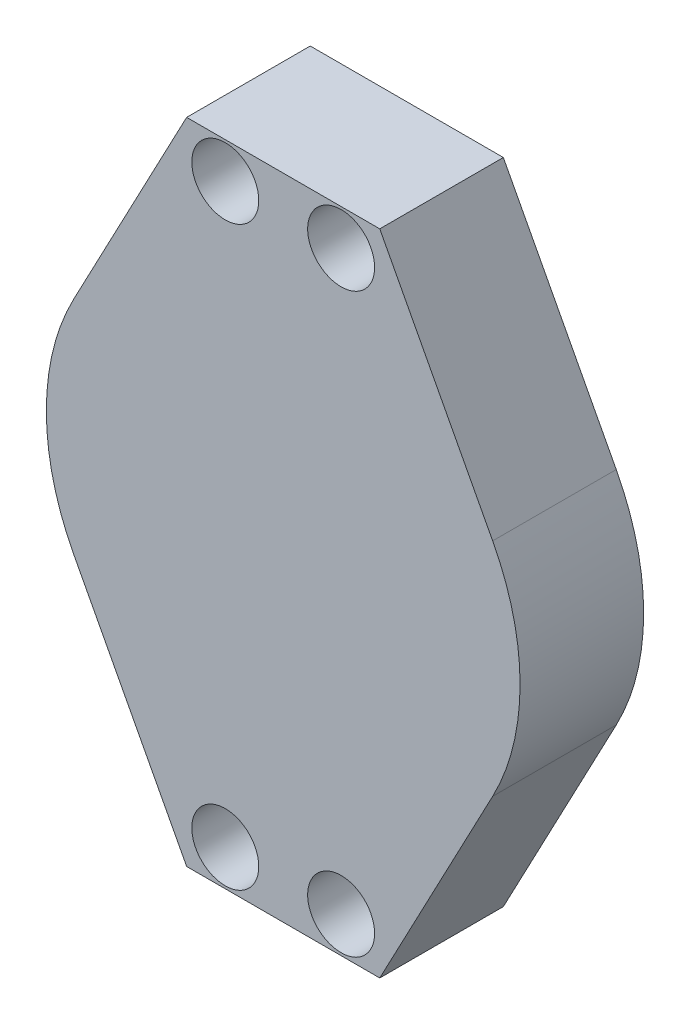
ISO-10303-21;
HEADER;
FILE_DESCRIPTION(('STEP AP214'),'2;1');
FILE_NAME('part.step','',(''),(''),'','','');
FILE_SCHEMA(('AUTOMOTIVE_DESIGN { 1 0 10303 214 1 1 1 1 }'));
ENDSEC;
DATA;
#1=APPLICATION_CONTEXT('core data for automotive mechanical design processes');
#2=APPLICATION_PROTOCOL_DEFINITION('international standard','automotive_design',2000,#1);
#3=PRODUCT_CONTEXT('',#1,'mechanical');
#4=PRODUCT('Part','Part','',(#3));
#5=PRODUCT_RELATED_PRODUCT_CATEGORY('part','',(#4));
#6=PRODUCT_DEFINITION_FORMATION('','',#4);
#7=PRODUCT_DEFINITION_CONTEXT('part definition',#1,'design');
#8=PRODUCT_DEFINITION('design','',#6,#7);
#9=PRODUCT_DEFINITION_SHAPE('','',#8);
#10=(LENGTH_UNIT() NAMED_UNIT(*) SI_UNIT(.MILLI.,.METRE.));
#11=(NAMED_UNIT(*) PLANE_ANGLE_UNIT() SI_UNIT($,.RADIAN.));
#12=(NAMED_UNIT(*) SI_UNIT($,.STERADIAN.) SOLID_ANGLE_UNIT());
#13=UNCERTAINTY_MEASURE_WITH_UNIT(LENGTH_MEASURE(1.E-05),#10,'distance_accuracy_value','');
#14=(GEOMETRIC_REPRESENTATION_CONTEXT(3) GLOBAL_UNCERTAINTY_ASSIGNED_CONTEXT((#13)) GLOBAL_UNIT_ASSIGNED_CONTEXT((#10,
#11,#12)) REPRESENTATION_CONTEXT('',''));
#15=CARTESIAN_POINT('',(0.,0.,0.));
#16=DIRECTION('',(0.,0.,1.));
#17=DIRECTION('',(1.,0.,0.));
#18=AXIS2_PLACEMENT_3D('',#15,#16,#17);
#19=CARTESIAN_POINT('',(-37.5,126.,48.));
#20=DIRECTION('',(0.884265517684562,-0.466984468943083,0.));
#21=DIRECTION('',(0.466984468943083,0.884265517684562,0.));
#22=AXIS2_PLACEMENT_3D('',#19,#20,#21);
#23=PLANE('',#22);
#24=DIRECTION('',(-0.466984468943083,-0.884265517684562,0.));
#25=VECTOR('',#24,1.);
#26=CARTESIAN_POINT('',(-37.5,126.,0.));
#27=LINE('',#26,#25);
#28=CARTESIAN_POINT('',(-37.5,126.,0.));
#29=VERTEX_POINT('',#28);
#30=CARTESIAN_POINT('',(-81.3524276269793,42.9625711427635,0.));
#31=VERTEX_POINT('',#30);
#32=EDGE_CURVE('E95',#29,#31,#27,.T.);
#33=ORIENTED_EDGE('',*,*,#32,.T.);
#34=DIRECTION('',(0.,0.,-1.));
#35=VECTOR('',#34,1.);
#36=CARTESIAN_POINT('',(-81.3524276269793,42.9625711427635,48.));
#37=LINE('',#36,#35);
#38=CARTESIAN_POINT('',(-81.3524276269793,42.9625711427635,48.));
#39=VERTEX_POINT('',#38);
#40=EDGE_CURVE('E11',#39,#31,#37,.T.);
#41=ORIENTED_EDGE('',*,*,#40,.F.);
#42=DIRECTION('',(-0.466984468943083,-0.884265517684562,0.));
#43=VECTOR('',#42,1.);
#44=CARTESIAN_POINT('',(-37.5,126.,48.));
#45=LINE('',#44,#43);
#46=CARTESIAN_POINT('',(-37.5,126.,48.));
#47=VERTEX_POINT('',#46);
#48=EDGE_CURVE('E127',#47,#39,#45,.T.);
#49=ORIENTED_EDGE('',*,*,#48,.F.);
#50=DIRECTION('',(0.,0.,-1.));
#51=VECTOR('',#50,1.);
#52=CARTESIAN_POINT('',(-37.5,126.,48.));
#53=LINE('',#52,#51);
#54=EDGE_CURVE('E108',#47,#29,#53,.T.);
#55=ORIENTED_EDGE('',*,*,#54,.T.);
#56=EDGE_LOOP('',(#33,#41,#49,#55));
#57=FACE_BOUND('',#56,.T.);
#58=ADVANCED_FACE('F27',(#57),#23,.F.);
#59=CARTESIAN_POINT('',(0.,0.,48.));
#60=DIRECTION('',(0.,0.,-1.));
#61=DIRECTION('',(-1.,0.,0.));
#62=AXIS2_PLACEMENT_3D('',#59,#60,#61);
#63=CYLINDRICAL_SURFACE('',#62,91.9999999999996);
#64=CARTESIAN_POINT('',(0.,0.,0.));
#65=DIRECTION('',(0.,0.,1.));
#66=DIRECTION('',(1.,0.,0.));
#67=AXIS2_PLACEMENT_3D('',#64,#65,#66);
#68=CIRCLE('',#67,91.9999999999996);
#69=CARTESIAN_POINT('',(-81.3524276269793,-42.9625711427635,0.));
#70=VERTEX_POINT('',#69);
#71=EDGE_CURVE('E91',#31,#70,#68,.T.);
#72=ORIENTED_EDGE('',*,*,#71,.T.);
#73=DIRECTION('',(0.,0.,-1.));
#74=VECTOR('',#73,1.);
#75=CARTESIAN_POINT('',(-81.3524276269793,-42.9625711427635,48.));
#76=LINE('',#75,#74);
#77=CARTESIAN_POINT('',(-81.3524276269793,-42.9625711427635,48.));
#78=VERTEX_POINT('',#77);
#79=EDGE_CURVE('E34',#78,#70,#76,.T.);
#80=ORIENTED_EDGE('',*,*,#79,.F.);
#81=CARTESIAN_POINT('',(0.,0.,48.));
#82=DIRECTION('',(0.,0.,1.));
#83=DIRECTION('',(1.,0.,0.));
#84=AXIS2_PLACEMENT_3D('',#81,#82,#83);
#85=CIRCLE('',#84,91.9999999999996);
#86=EDGE_CURVE('E104',#39,#78,#85,.T.);
#87=ORIENTED_EDGE('',*,*,#86,.F.);
#88=ORIENTED_EDGE('',*,*,#40,.T.);
#89=EDGE_LOOP('',(#72,#80,#87,#88));
#90=FACE_BOUND('',#89,.T.);
#91=ADVANCED_FACE('F103',(#90),#63,.T.);
#92=CARTESIAN_POINT('',(-37.5,-126.,48.));
#93=DIRECTION('',(0.884265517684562,0.466984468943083,0.));
#94=DIRECTION('',(-0.466984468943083,0.884265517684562,0.));
#95=AXIS2_PLACEMENT_3D('',#92,#93,#94);
#96=PLANE('',#95);
#97=DIRECTION('',(0.466984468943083,-0.884265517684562,0.));
#98=VECTOR('',#97,1.);
#99=CARTESIAN_POINT('',(-37.5,-126.,0.));
#100=LINE('',#99,#98);
#101=CARTESIAN_POINT('',(-37.5,-126.,0.));
#102=VERTEX_POINT('',#101);
#103=EDGE_CURVE('E97',#70,#102,#100,.T.);
#104=ORIENTED_EDGE('',*,*,#103,.T.);
#105=DIRECTION('',(0.,0.,-1.));
#106=VECTOR('',#105,1.);
#107=CARTESIAN_POINT('',(-37.5,-126.,48.));
#108=LINE('',#107,#106);
#109=CARTESIAN_POINT('',(-37.5,-126.,48.));
#110=VERTEX_POINT('',#109);
#111=EDGE_CURVE('E153',#110,#102,#108,.T.);
#112=ORIENTED_EDGE('',*,*,#111,.F.);
#113=DIRECTION('',(0.466984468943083,-0.884265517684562,0.));
#114=VECTOR('',#113,1.);
#115=CARTESIAN_POINT('',(-37.5,-126.,48.));
#116=LINE('',#115,#114);
#117=EDGE_CURVE('E130',#78,#110,#116,.T.);
#118=ORIENTED_EDGE('',*,*,#117,.F.);
#119=ORIENTED_EDGE('',*,*,#79,.T.);
#120=EDGE_LOOP('',(#104,#112,#118,#119));
#121=FACE_BOUND('',#120,.T.);
#122=ADVANCED_FACE('F157',(#121),#96,.F.);
#123=CARTESIAN_POINT('',(-37.5,-126.,48.));
#124=DIRECTION('',(0.,1.,0.));
#125=DIRECTION('',(0.,0.,1.));
#126=AXIS2_PLACEMENT_3D('',#123,#124,#125);
#127=PLANE('',#126);
#128=DIRECTION('',(1.,0.,0.));
#129=VECTOR('',#128,1.);
#130=CARTESIAN_POINT('',(-37.5,-126.,0.));
#131=LINE('',#130,#129);
#132=CARTESIAN_POINT('',(37.5,-126.,0.));
#133=VERTEX_POINT('',#132);
#134=EDGE_CURVE('E117',#102,#133,#131,.T.);
#135=ORIENTED_EDGE('',*,*,#134,.T.);
#136=DIRECTION('',(0.,0.,-1.));
#137=VECTOR('',#136,1.);
#138=CARTESIAN_POINT('',(37.5,-126.,48.));
#139=LINE('',#138,#137);
#140=CARTESIAN_POINT('',(37.5,-126.,48.));
#141=VERTEX_POINT('',#140);
#142=EDGE_CURVE('E150',#141,#133,#139,.T.);
#143=ORIENTED_EDGE('',*,*,#142,.F.);
#144=DIRECTION('',(1.,0.,0.));
#145=VECTOR('',#144,1.);
#146=CARTESIAN_POINT('',(-37.5,-126.,48.));
#147=LINE('',#146,#145);
#148=EDGE_CURVE('E132',#110,#141,#147,.T.);
#149=ORIENTED_EDGE('',*,*,#148,.F.);
#150=ORIENTED_EDGE('',*,*,#111,.T.);
#151=EDGE_LOOP('',(#135,#143,#149,#150));
#152=FACE_BOUND('',#151,.T.);
#153=ADVANCED_FACE('F165',(#152),#127,.F.);
#154=CARTESIAN_POINT('',(37.5,-126.,48.));
#155=DIRECTION('',(-0.884265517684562,0.466984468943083,0.));
#156=DIRECTION('',(-0.466984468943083,-0.884265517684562,0.));
#157=AXIS2_PLACEMENT_3D('',#154,#155,#156);
#158=PLANE('',#157);
#159=DIRECTION('',(0.466984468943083,0.884265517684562,0.));
#160=VECTOR('',#159,1.);
#161=CARTESIAN_POINT('',(37.5,-126.,0.));
#162=LINE('',#161,#160);
#163=CARTESIAN_POINT('',(81.3524276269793,-42.9625711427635,0.));
#164=VERTEX_POINT('',#163);
#165=EDGE_CURVE('E119',#133,#164,#162,.T.);
#166=ORIENTED_EDGE('',*,*,#165,.T.);
#167=DIRECTION('',(0.,0.,-1.));
#168=VECTOR('',#167,1.);
#169=CARTESIAN_POINT('',(81.3524276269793,-42.9625711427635,48.));
#170=LINE('',#169,#168);
#171=CARTESIAN_POINT('',(81.3524276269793,-42.9625711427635,48.));
#172=VERTEX_POINT('',#171);
#173=EDGE_CURVE('E147',#172,#164,#170,.T.);
#174=ORIENTED_EDGE('',*,*,#173,.F.);
#175=DIRECTION('',(0.466984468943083,0.884265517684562,0.));
#176=VECTOR('',#175,1.);
#177=CARTESIAN_POINT('',(37.5,-126.,48.));
#178=LINE('',#177,#176);
#179=EDGE_CURVE('E134',#141,#172,#178,.T.);
#180=ORIENTED_EDGE('',*,*,#179,.F.);
#181=ORIENTED_EDGE('',*,*,#142,.T.);
#182=EDGE_LOOP('',(#166,#174,#180,#181));
#183=FACE_BOUND('',#182,.T.);
#184=ADVANCED_FACE('F168',(#183),#158,.F.);
#185=CARTESIAN_POINT('',(0.,0.,48.));
#186=DIRECTION('',(0.,0.,-1.));
#187=DIRECTION('',(-1.,0.,0.));
#188=AXIS2_PLACEMENT_3D('',#185,#186,#187);
#189=CYLINDRICAL_SURFACE('',#188,91.9999999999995);
#190=CARTESIAN_POINT('',(0.,0.,0.));
#191=DIRECTION('',(0.,0.,1.));
#192=DIRECTION('',(1.,0.,0.));
#193=AXIS2_PLACEMENT_3D('',#190,#191,#192);
#194=CIRCLE('',#193,91.9999999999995);
#195=CARTESIAN_POINT('',(81.3524276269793,42.9625711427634,0.));
#196=VERTEX_POINT('',#195);
#197=EDGE_CURVE('E121',#164,#196,#194,.T.);
#198=ORIENTED_EDGE('',*,*,#197,.T.);
#199=DIRECTION('',(0.,0.,-1.));
#200=VECTOR('',#199,1.);
#201=CARTESIAN_POINT('',(81.3524276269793,42.9625711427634,48.));
#202=LINE('',#201,#200);
#203=CARTESIAN_POINT('',(81.3524276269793,42.9625711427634,48.));
#204=VERTEX_POINT('',#203);
#205=EDGE_CURVE('E144',#204,#196,#202,.T.);
#206=ORIENTED_EDGE('',*,*,#205,.F.);
#207=CARTESIAN_POINT('',(0.,0.,48.));
#208=DIRECTION('',(0.,0.,1.));
#209=DIRECTION('',(1.,0.,0.));
#210=AXIS2_PLACEMENT_3D('',#207,#208,#209);
#211=CIRCLE('',#210,91.9999999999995);
#212=EDGE_CURVE('E136',#172,#204,#211,.T.);
#213=ORIENTED_EDGE('',*,*,#212,.F.);
#214=ORIENTED_EDGE('',*,*,#173,.T.);
#215=EDGE_LOOP('',(#198,#206,#213,#214));
#216=FACE_BOUND('',#215,.T.);
#217=ADVANCED_FACE('F173',(#216),#189,.T.);
#218=CARTESIAN_POINT('',(37.5,126.,48.));
#219=DIRECTION('',(-0.884265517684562,-0.466984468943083,0.));
#220=DIRECTION('',(0.466984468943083,-0.884265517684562,0.));
#221=AXIS2_PLACEMENT_3D('',#218,#219,#220);
#222=PLANE('',#221);
#223=DIRECTION('',(-0.466984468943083,0.884265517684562,0.));
#224=VECTOR('',#223,1.);
#225=CARTESIAN_POINT('',(37.5,126.,0.));
#226=LINE('',#225,#224);
#227=CARTESIAN_POINT('',(37.5,126.,0.));
#228=VERTEX_POINT('',#227);
#229=EDGE_CURVE('E123',#196,#228,#226,.T.);
#230=ORIENTED_EDGE('',*,*,#229,.T.);
#231=DIRECTION('',(0.,0.,-1.));
#232=VECTOR('',#231,1.);
#233=CARTESIAN_POINT('',(37.5,126.,48.));
#234=LINE('',#233,#232);
#235=CARTESIAN_POINT('',(37.5,126.,48.));
#236=VERTEX_POINT('',#235);
#237=EDGE_CURVE('E141',#236,#228,#234,.T.);
#238=ORIENTED_EDGE('',*,*,#237,.F.);
#239=DIRECTION('',(-0.466984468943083,0.884265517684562,0.));
#240=VECTOR('',#239,1.);
#241=CARTESIAN_POINT('',(37.5,126.,48.));
#242=LINE('',#241,#240);
#243=EDGE_CURVE('E46',#204,#236,#242,.T.);
#244=ORIENTED_EDGE('',*,*,#243,.F.);
#245=ORIENTED_EDGE('',*,*,#205,.T.);
#246=EDGE_LOOP('',(#230,#238,#244,#245));
#247=FACE_BOUND('',#246,.T.);
#248=ADVANCED_FACE('F176',(#247),#222,.F.);
#249=CARTESIAN_POINT('',(-37.5,126.,48.));
#250=DIRECTION('',(0.,-1.,0.));
#251=DIRECTION('',(0.,0.,-1.));
#252=AXIS2_PLACEMENT_3D('',#249,#250,#251);
#253=PLANE('',#252);
#254=DIRECTION('',(-1.,0.,0.));
#255=VECTOR('',#254,1.);
#256=CARTESIAN_POINT('',(-37.5,126.,0.));
#257=LINE('',#256,#255);
#258=EDGE_CURVE('E125',#228,#29,#257,.T.);
#259=ORIENTED_EDGE('',*,*,#258,.T.);
#260=ORIENTED_EDGE('',*,*,#54,.F.);
#261=DIRECTION('',(-1.,0.,0.));
#262=VECTOR('',#261,1.);
#263=CARTESIAN_POINT('',(-37.5,126.,48.));
#264=LINE('',#263,#262);
#265=EDGE_CURVE('E41',#236,#47,#264,.T.);
#266=ORIENTED_EDGE('',*,*,#265,.F.);
#267=ORIENTED_EDGE('',*,*,#237,.T.);
#268=EDGE_LOOP('',(#259,#260,#266,#267));
#269=FACE_BOUND('',#268,.T.);
#270=ADVANCED_FACE('F178',(#269),#253,.F.);
#271=CARTESIAN_POINT('',(0.,0.,48.));
#272=DIRECTION('',(0.,0.,1.));
#273=DIRECTION('',(1.,0.,0.));
#274=AXIS2_PLACEMENT_3D('',#271,#272,#273);
#275=PLANE('',#274);
#276=CARTESIAN_POINT('',(-22.5,-112.,48.));
#277=DIRECTION('',(0.,0.,1.));
#278=DIRECTION('',(1.,0.,0.));
#279=AXIS2_PLACEMENT_3D('',#276,#277,#278);
#280=CIRCLE('',#279,13.);
#281=CARTESIAN_POINT('',(-9.50000000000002,-112.,48.));
#282=VERTEX_POINT('',#281);
#283=EDGE_CURVE('E347',#282,#282,#280,.T.);
#284=ORIENTED_EDGE('',*,*,#283,.F.);
#285=EDGE_LOOP('',(#284));
#286=FACE_BOUND('',#285,.T.);
#287=CARTESIAN_POINT('',(22.5,-112.,48.));
#288=DIRECTION('',(0.,0.,1.));
#289=DIRECTION('',(1.,0.,0.));
#290=AXIS2_PLACEMENT_3D('',#287,#288,#289);
#291=CIRCLE('',#290,13.);
#292=CARTESIAN_POINT('',(35.5,-112.,48.));
#293=VERTEX_POINT('',#292);
#294=EDGE_CURVE('E362',#293,#293,#291,.T.);
#295=ORIENTED_EDGE('',*,*,#294,.F.);
#296=EDGE_LOOP('',(#295));
#297=FACE_BOUND('',#296,.T.);
#298=CARTESIAN_POINT('',(22.5,112.,48.));
#299=DIRECTION('',(0.,0.,1.));
#300=DIRECTION('',(1.,0.,0.));
#301=AXIS2_PLACEMENT_3D('',#298,#299,#300);
#302=CIRCLE('',#301,13.);
#303=CARTESIAN_POINT('',(35.5,112.,48.));
#304=VERTEX_POINT('',#303);
#305=EDGE_CURVE('E374',#304,#304,#302,.T.);
#306=ORIENTED_EDGE('',*,*,#305,.F.);
#307=EDGE_LOOP('',(#306));
#308=FACE_BOUND('',#307,.T.);
#309=CARTESIAN_POINT('',(-22.5,112.,48.));
#310=DIRECTION('',(0.,0.,1.));
#311=DIRECTION('',(1.,0.,0.));
#312=AXIS2_PLACEMENT_3D('',#309,#310,#311);
#313=CIRCLE('',#312,13.);
#314=CARTESIAN_POINT('',(-9.50000000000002,112.,48.));
#315=VERTEX_POINT('',#314);
#316=EDGE_CURVE('E386',#315,#315,#313,.T.);
#317=ORIENTED_EDGE('',*,*,#316,.F.);
#318=EDGE_LOOP('',(#317));
#319=FACE_BOUND('',#318,.T.);
#320=ORIENTED_EDGE('',*,*,#48,.T.);
#321=ORIENTED_EDGE('',*,*,#86,.T.);
#322=ORIENTED_EDGE('',*,*,#117,.T.);
#323=ORIENTED_EDGE('',*,*,#148,.T.);
#324=ORIENTED_EDGE('',*,*,#179,.T.);
#325=ORIENTED_EDGE('',*,*,#212,.T.);
#326=ORIENTED_EDGE('',*,*,#243,.T.);
#327=ORIENTED_EDGE('',*,*,#265,.T.);
#328=EDGE_LOOP('',(#320,#321,#322,#323,#324,#325,#326,#327));
#329=FACE_BOUND('',#328,.T.);
#330=ADVANCED_FACE('F160',(#286,#297,#308,#319,#329),#275,.T.);
#331=CARTESIAN_POINT('',(0.,0.,0.));
#332=DIRECTION('',(0.,0.,1.));
#333=DIRECTION('',(1.,0.,0.));
#334=AXIS2_PLACEMENT_3D('',#331,#332,#333);
#335=PLANE('',#334);
#336=CARTESIAN_POINT('',(-22.5,-112.,0.));
#337=DIRECTION('',(0.,0.,1.));
#338=DIRECTION('',(1.,0.,0.));
#339=AXIS2_PLACEMENT_3D('',#336,#337,#338);
#340=CIRCLE('',#339,6.49999999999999);
#341=CARTESIAN_POINT('',(-16.,-112.,0.));
#342=VERTEX_POINT('',#341);
#343=EDGE_CURVE('E340',#342,#342,#340,.T.);
#344=ORIENTED_EDGE('',*,*,#343,.T.);
#345=EDGE_LOOP('',(#344));
#346=FACE_BOUND('',#345,.T.);
#347=CARTESIAN_POINT('',(22.5,-112.,0.));
#348=DIRECTION('',(0.,0.,1.));
#349=DIRECTION('',(1.,0.,0.));
#350=AXIS2_PLACEMENT_3D('',#347,#348,#349);
#351=CIRCLE('',#350,6.49999999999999);
#352=CARTESIAN_POINT('',(29.,-112.,0.));
#353=VERTEX_POINT('',#352);
#354=EDGE_CURVE('E353',#353,#353,#351,.T.);
#355=ORIENTED_EDGE('',*,*,#354,.T.);
#356=EDGE_LOOP('',(#355));
#357=FACE_BOUND('',#356,.T.);
#358=CARTESIAN_POINT('',(22.5,112.,0.));
#359=DIRECTION('',(0.,0.,1.));
#360=DIRECTION('',(1.,0.,0.));
#361=AXIS2_PLACEMENT_3D('',#358,#359,#360);
#362=CIRCLE('',#361,6.49999999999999);
#363=CARTESIAN_POINT('',(29.,112.,0.));
#364=VERTEX_POINT('',#363);
#365=EDGE_CURVE('E365',#364,#364,#362,.T.);
#366=ORIENTED_EDGE('',*,*,#365,.T.);
#367=EDGE_LOOP('',(#366));
#368=FACE_BOUND('',#367,.T.);
#369=CARTESIAN_POINT('',(-22.5,112.,0.));
#370=DIRECTION('',(0.,0.,1.));
#371=DIRECTION('',(1.,0.,0.));
#372=AXIS2_PLACEMENT_3D('',#369,#370,#371);
#373=CIRCLE('',#372,6.49999999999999);
#374=CARTESIAN_POINT('',(-16.,112.,0.));
#375=VERTEX_POINT('',#374);
#376=EDGE_CURVE('E377',#375,#375,#373,.T.);
#377=ORIENTED_EDGE('',*,*,#376,.T.);
#378=EDGE_LOOP('',(#377));
#379=FACE_BOUND('',#378,.T.);
#380=CARTESIAN_POINT('',(0.,0.,0.));
#381=DIRECTION('',(0.,0.,-1.));
#382=DIRECTION('',(-1.,0.,0.));
#383=AXIS2_PLACEMENT_3D('',#380,#381,#382);
#384=CIRCLE('',#383,90.);
#385=CARTESIAN_POINT('',(-90.,0.,0.));
#386=VERTEX_POINT('',#385);
#387=EDGE_CURVE('E112',#386,#386,#384,.T.);
#388=ORIENTED_EDGE('',*,*,#387,.F.);
#389=EDGE_LOOP('',(#388));
#390=FACE_BOUND('',#389,.T.);
#391=ORIENTED_EDGE('',*,*,#32,.F.);
#392=ORIENTED_EDGE('',*,*,#258,.F.);
#393=ORIENTED_EDGE('',*,*,#229,.F.);
#394=ORIENTED_EDGE('',*,*,#197,.F.);
#395=ORIENTED_EDGE('',*,*,#165,.F.);
#396=ORIENTED_EDGE('',*,*,#134,.F.);
#397=ORIENTED_EDGE('',*,*,#103,.F.);
#398=ORIENTED_EDGE('',*,*,#71,.F.);
#399=EDGE_LOOP('',(#391,#392,#393,#394,#395,#396,#397,#398));
#400=FACE_BOUND('',#399,.T.);
#401=ADVANCED_FACE('F92',(#346,#357,#368,#379,#390,#400),#335,.F.);
#402=CARTESIAN_POINT('',(0.,0.,32.));
#403=DIRECTION('',(0.,0.,-1.));
#404=DIRECTION('',(-1.,0.,0.));
#405=AXIS2_PLACEMENT_3D('',#402,#403,#404);
#406=CYLINDRICAL_SURFACE('',#405,90.);
#407=CARTESIAN_POINT('',(0.,0.,32.));
#408=DIRECTION('',(0.,0.,-1.));
#409=DIRECTION('',(-1.,0.,0.));
#410=AXIS2_PLACEMENT_3D('',#407,#408,#409);
#411=CIRCLE('',#410,90.);
#412=CARTESIAN_POINT('',(-90.,0.,32.));
#413=VERTEX_POINT('',#412);
#414=EDGE_CURVE('E109',#413,#413,#411,.T.);
#415=ORIENTED_EDGE('',*,*,#414,.F.);
#416=EDGE_LOOP('',(#415));
#417=FACE_BOUND('',#416,.T.);
#418=ORIENTED_EDGE('',*,*,#387,.T.);
#419=EDGE_LOOP('',(#418));
#420=FACE_BOUND('',#419,.T.);
#421=ADVANCED_FACE('F225',(#417,#420),#406,.F.);
#422=CARTESIAN_POINT('',(0.,0.,32.));
#423=DIRECTION('',(0.,0.,-1.));
#424=DIRECTION('',(-1.,0.,0.));
#425=AXIS2_PLACEMENT_3D('',#422,#423,#424);
#426=PLANE('',#425);
#427=ORIENTED_EDGE('',*,*,#414,.T.);
#428=EDGE_LOOP('',(#427));
#429=FACE_BOUND('',#428,.T.);
#430=ADVANCED_FACE('F233',(#429),#426,.T.);
#431=CARTESIAN_POINT('',(-22.5,112.,48.));
#432=DIRECTION('',(0.,0.,1.));
#433=DIRECTION('',(1.,0.,0.));
#434=AXIS2_PLACEMENT_3D('',#431,#432,#433);
#435=CYLINDRICAL_SURFACE('',#434,13.);
#436=CARTESIAN_POINT('',(-22.5,112.,10.5));
#437=DIRECTION('',(0.,0.,1.));
#438=DIRECTION('',(1.,0.,0.));
#439=AXIS2_PLACEMENT_3D('',#436,#437,#438);
#440=CIRCLE('',#439,13.);
#441=CARTESIAN_POINT('',(-9.50000000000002,112.,10.5));
#442=VERTEX_POINT('',#441);
#443=EDGE_CURVE('E383',#442,#442,#440,.T.);
#444=ORIENTED_EDGE('',*,*,#443,.F.);
#445=EDGE_LOOP('',(#444));
#446=FACE_BOUND('',#445,.T.);
#447=ORIENTED_EDGE('',*,*,#316,.T.);
#448=EDGE_LOOP('',(#447));
#449=FACE_BOUND('',#448,.T.);
#450=ADVANCED_FACE('F241',(#446,#449),#435,.F.);
#451=CARTESIAN_POINT('',(-16.,112.,10.5));
#452=DIRECTION('',(0.,0.,-1.));
#453=DIRECTION('',(-1.,0.,0.));
#454=AXIS2_PLACEMENT_3D('',#451,#452,#453);
#455=PLANE('',#454);
#456=CARTESIAN_POINT('',(-22.5,112.,10.5));
#457=DIRECTION('',(0.,0.,1.));
#458=DIRECTION('',(1.,0.,0.));
#459=AXIS2_PLACEMENT_3D('',#456,#457,#458);
#460=CIRCLE('',#459,6.49999999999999);
#461=CARTESIAN_POINT('',(-16.,112.,10.5));
#462=VERTEX_POINT('',#461);
#463=EDGE_CURVE('E380',#462,#462,#460,.T.);
#464=ORIENTED_EDGE('',*,*,#463,.F.);
#465=EDGE_LOOP('',(#464));
#466=FACE_BOUND('',#465,.T.);
#467=ORIENTED_EDGE('',*,*,#443,.T.);
#468=EDGE_LOOP('',(#467));
#469=FACE_BOUND('',#468,.T.);
#470=ADVANCED_FACE('F249',(#466,#469),#455,.F.);
#471=CARTESIAN_POINT('',(-22.5,112.,48.));
#472=DIRECTION('',(0.,0.,1.));
#473=DIRECTION('',(1.,0.,0.));
#474=AXIS2_PLACEMENT_3D('',#471,#472,#473);
#475=CYLINDRICAL_SURFACE('',#474,6.49999999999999);
#476=ORIENTED_EDGE('',*,*,#376,.F.);
#477=EDGE_LOOP('',(#476));
#478=FACE_BOUND('',#477,.T.);
#479=ORIENTED_EDGE('',*,*,#463,.T.);
#480=EDGE_LOOP('',(#479));
#481=FACE_BOUND('',#480,.T.);
#482=ADVANCED_FACE('F257',(#478,#481),#475,.F.);
#483=CARTESIAN_POINT('',(22.5,112.,48.));
#484=DIRECTION('',(0.,0.,1.));
#485=DIRECTION('',(1.,0.,0.));
#486=AXIS2_PLACEMENT_3D('',#483,#484,#485);
#487=CYLINDRICAL_SURFACE('',#486,13.);
#488=CARTESIAN_POINT('',(22.5,112.,10.5));
#489=DIRECTION('',(0.,0.,1.));
#490=DIRECTION('',(1.,0.,0.));
#491=AXIS2_PLACEMENT_3D('',#488,#489,#490);
#492=CIRCLE('',#491,13.);
#493=CARTESIAN_POINT('',(35.5,112.,10.5));
#494=VERTEX_POINT('',#493);
#495=EDGE_CURVE('E371',#494,#494,#492,.T.);
#496=ORIENTED_EDGE('',*,*,#495,.F.);
#497=EDGE_LOOP('',(#496));
#498=FACE_BOUND('',#497,.T.);
#499=ORIENTED_EDGE('',*,*,#305,.T.);
#500=EDGE_LOOP('',(#499));
#501=FACE_BOUND('',#500,.T.);
#502=ADVANCED_FACE('F265',(#498,#501),#487,.F.);
#503=CARTESIAN_POINT('',(29.,112.,10.5));
#504=DIRECTION('',(0.,0.,-1.));
#505=DIRECTION('',(-1.,0.,0.));
#506=AXIS2_PLACEMENT_3D('',#503,#504,#505);
#507=PLANE('',#506);
#508=CARTESIAN_POINT('',(22.5,112.,10.5));
#509=DIRECTION('',(0.,0.,1.));
#510=DIRECTION('',(1.,0.,0.));
#511=AXIS2_PLACEMENT_3D('',#508,#509,#510);
#512=CIRCLE('',#511,6.49999999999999);
#513=CARTESIAN_POINT('',(29.,112.,10.5));
#514=VERTEX_POINT('',#513);
#515=EDGE_CURVE('E368',#514,#514,#512,.T.);
#516=ORIENTED_EDGE('',*,*,#515,.F.);
#517=EDGE_LOOP('',(#516));
#518=FACE_BOUND('',#517,.T.);
#519=ORIENTED_EDGE('',*,*,#495,.T.);
#520=EDGE_LOOP('',(#519));
#521=FACE_BOUND('',#520,.T.);
#522=ADVANCED_FACE('F273',(#518,#521),#507,.F.);
#523=CARTESIAN_POINT('',(22.5,112.,48.));
#524=DIRECTION('',(0.,0.,1.));
#525=DIRECTION('',(1.,0.,0.));
#526=AXIS2_PLACEMENT_3D('',#523,#524,#525);
#527=CYLINDRICAL_SURFACE('',#526,6.49999999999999);
#528=ORIENTED_EDGE('',*,*,#365,.F.);
#529=EDGE_LOOP('',(#528));
#530=FACE_BOUND('',#529,.T.);
#531=ORIENTED_EDGE('',*,*,#515,.T.);
#532=EDGE_LOOP('',(#531));
#533=FACE_BOUND('',#532,.T.);
#534=ADVANCED_FACE('F281',(#530,#533),#527,.F.);
#535=CARTESIAN_POINT('',(22.5,-112.,48.));
#536=DIRECTION('',(0.,0.,1.));
#537=DIRECTION('',(1.,0.,0.));
#538=AXIS2_PLACEMENT_3D('',#535,#536,#537);
#539=CYLINDRICAL_SURFACE('',#538,13.);
#540=CARTESIAN_POINT('',(22.5,-112.,10.5));
#541=DIRECTION('',(0.,0.,1.));
#542=DIRECTION('',(1.,0.,0.));
#543=AXIS2_PLACEMENT_3D('',#540,#541,#542);
#544=CIRCLE('',#543,13.);
#545=CARTESIAN_POINT('',(35.5,-112.,10.5));
#546=VERTEX_POINT('',#545);
#547=EDGE_CURVE('E359',#546,#546,#544,.T.);
#548=ORIENTED_EDGE('',*,*,#547,.F.);
#549=EDGE_LOOP('',(#548));
#550=FACE_BOUND('',#549,.T.);
#551=ORIENTED_EDGE('',*,*,#294,.T.);
#552=EDGE_LOOP('',(#551));
#553=FACE_BOUND('',#552,.T.);
#554=ADVANCED_FACE('F288',(#550,#553),#539,.F.);
#555=CARTESIAN_POINT('',(29.,-112.,10.5));
#556=DIRECTION('',(0.,0.,-1.));
#557=DIRECTION('',(-1.,0.,0.));
#558=AXIS2_PLACEMENT_3D('',#555,#556,#557);
#559=PLANE('',#558);
#560=CARTESIAN_POINT('',(22.5,-112.,10.5));
#561=DIRECTION('',(0.,0.,1.));
#562=DIRECTION('',(1.,0.,0.));
#563=AXIS2_PLACEMENT_3D('',#560,#561,#562);
#564=CIRCLE('',#563,6.49999999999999);
#565=CARTESIAN_POINT('',(29.,-112.,10.5));
#566=VERTEX_POINT('',#565);
#567=EDGE_CURVE('E356',#566,#566,#564,.T.);
#568=ORIENTED_EDGE('',*,*,#567,.F.);
#569=EDGE_LOOP('',(#568));
#570=FACE_BOUND('',#569,.T.);
#571=ORIENTED_EDGE('',*,*,#547,.T.);
#572=EDGE_LOOP('',(#571));
#573=FACE_BOUND('',#572,.T.);
#574=ADVANCED_FACE('F295',(#570,#573),#559,.F.);
#575=CARTESIAN_POINT('',(22.5,-112.,48.));
#576=DIRECTION('',(0.,0.,1.));
#577=DIRECTION('',(1.,0.,0.));
#578=AXIS2_PLACEMENT_3D('',#575,#576,#577);
#579=CYLINDRICAL_SURFACE('',#578,6.49999999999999);
#580=ORIENTED_EDGE('',*,*,#354,.F.);
#581=EDGE_LOOP('',(#580));
#582=FACE_BOUND('',#581,.T.);
#583=ORIENTED_EDGE('',*,*,#567,.T.);
#584=EDGE_LOOP('',(#583));
#585=FACE_BOUND('',#584,.T.);
#586=ADVANCED_FACE('F303',(#582,#585),#579,.F.);
#587=CARTESIAN_POINT('',(-22.5,-112.,48.));
#588=DIRECTION('',(0.,0.,1.));
#589=DIRECTION('',(1.,0.,0.));
#590=AXIS2_PLACEMENT_3D('',#587,#588,#589);
#591=CYLINDRICAL_SURFACE('',#590,13.);
#592=CARTESIAN_POINT('',(-22.5,-112.,10.5));
#593=DIRECTION('',(0.,0.,1.));
#594=DIRECTION('',(1.,0.,0.));
#595=AXIS2_PLACEMENT_3D('',#592,#593,#594);
#596=CIRCLE('',#595,13.);
#597=CARTESIAN_POINT('',(-9.50000000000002,-112.,10.5));
#598=VERTEX_POINT('',#597);
#599=EDGE_CURVE('E344',#598,#598,#596,.T.);
#600=ORIENTED_EDGE('',*,*,#599,.F.);
#601=EDGE_LOOP('',(#600));
#602=FACE_BOUND('',#601,.T.);
#603=ORIENTED_EDGE('',*,*,#283,.T.);
#604=EDGE_LOOP('',(#603));
#605=FACE_BOUND('',#604,.T.);
#606=ADVANCED_FACE('F311',(#602,#605),#591,.F.);
#607=CARTESIAN_POINT('',(-16.,-112.,10.5));
#608=DIRECTION('',(0.,0.,-1.));
#609=DIRECTION('',(-1.,0.,0.));
#610=AXIS2_PLACEMENT_3D('',#607,#608,#609);
#611=PLANE('',#610);
#612=CARTESIAN_POINT('',(-22.5,-112.,10.5));
#613=DIRECTION('',(0.,0.,1.));
#614=DIRECTION('',(1.,0.,0.));
#615=AXIS2_PLACEMENT_3D('',#612,#613,#614);
#616=CIRCLE('',#615,6.49999999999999);
#617=CARTESIAN_POINT('',(-16.,-112.,10.5));
#618=VERTEX_POINT('',#617);
#619=EDGE_CURVE('E343',#618,#618,#616,.T.);
#620=ORIENTED_EDGE('',*,*,#619,.F.);
#621=EDGE_LOOP('',(#620));
#622=FACE_BOUND('',#621,.T.);
#623=ORIENTED_EDGE('',*,*,#599,.T.);
#624=EDGE_LOOP('',(#623));
#625=FACE_BOUND('',#624,.T.);
#626=ADVANCED_FACE('F319',(#622,#625),#611,.F.);
#627=CARTESIAN_POINT('',(-22.5,-112.,48.));
#628=DIRECTION('',(0.,0.,1.));
#629=DIRECTION('',(1.,0.,0.));
#630=AXIS2_PLACEMENT_3D('',#627,#628,#629);
#631=CYLINDRICAL_SURFACE('',#630,6.49999999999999);
#632=ORIENTED_EDGE('',*,*,#343,.F.);
#633=EDGE_LOOP('',(#632));
#634=FACE_BOUND('',#633,.T.);
#635=ORIENTED_EDGE('',*,*,#619,.T.);
#636=EDGE_LOOP('',(#635));
#637=FACE_BOUND('',#636,.T.);
#638=ADVANCED_FACE('F327',(#634,#637),#631,.F.);
#639=CLOSED_SHELL('',(#58,#91,#122,#153,#184,#217,#248,#270,#330,#401,#421,#430,#450,#470,#482,
#502,#522,#534,#554,#574,#586,#606,#626,#638));
#640=MANIFOLD_SOLID_BREP('B2',#639);
#641=ADVANCED_BREP_SHAPE_REPRESENTATION('',(#18,#640),#14);
#642=SHAPE_DEFINITION_REPRESENTATION(#9,#641);
ENDSEC;
END-ISO-10303-21;
